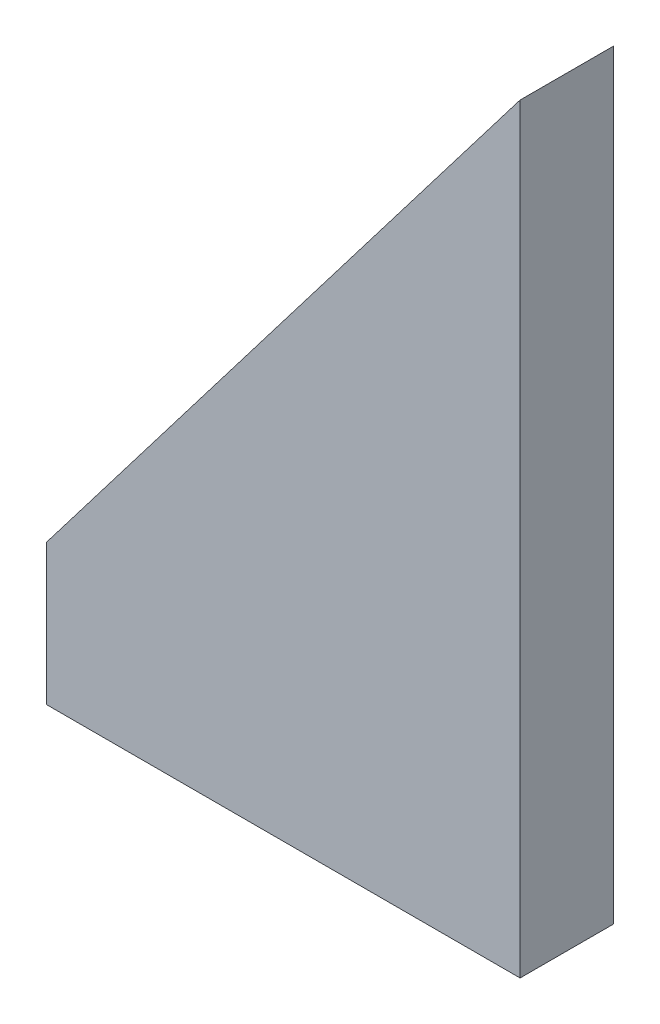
ISO-10303-21;
HEADER;
FILE_DESCRIPTION(('STEP AP214'),'2;1');
FILE_NAME('part.step','',(''),(''),'','','');
FILE_SCHEMA(('AUTOMOTIVE_DESIGN { 1 0 10303 214 1 1 1 1 }'));
ENDSEC;
DATA;
#1=APPLICATION_CONTEXT('core data for automotive mechanical design processes');
#2=APPLICATION_PROTOCOL_DEFINITION('international standard','automotive_design',2000,#1);
#3=PRODUCT_CONTEXT('',#1,'mechanical');
#4=PRODUCT('Part','Part','',(#3));
#5=PRODUCT_RELATED_PRODUCT_CATEGORY('part','',(#4));
#6=PRODUCT_DEFINITION_FORMATION('','',#4);
#7=PRODUCT_DEFINITION_CONTEXT('part definition',#1,'design');
#8=PRODUCT_DEFINITION('design','',#6,#7);
#9=PRODUCT_DEFINITION_SHAPE('','',#8);
#10=(LENGTH_UNIT() NAMED_UNIT(*) SI_UNIT(.MILLI.,.METRE.));
#11=(NAMED_UNIT(*) PLANE_ANGLE_UNIT() SI_UNIT($,.RADIAN.));
#12=(NAMED_UNIT(*) SI_UNIT($,.STERADIAN.) SOLID_ANGLE_UNIT());
#13=UNCERTAINTY_MEASURE_WITH_UNIT(LENGTH_MEASURE(1.E-05),#10,'distance_accuracy_value','');
#14=(GEOMETRIC_REPRESENTATION_CONTEXT(3) GLOBAL_UNCERTAINTY_ASSIGNED_CONTEXT((#13)) GLOBAL_UNIT_ASSIGNED_CONTEXT((#10,
#11,#12)) REPRESENTATION_CONTEXT('',''));
#15=CARTESIAN_POINT('',(0.,0.,0.));
#16=DIRECTION('',(0.,0.,1.));
#17=DIRECTION('',(1.,0.,0.));
#18=AXIS2_PLACEMENT_3D('',#15,#16,#17);
#19=CARTESIAN_POINT('',(40.5,0.,8.));
#20=DIRECTION('',(0.,1.,0.));
#21=DIRECTION('',(-1.,0.,0.));
#22=AXIS2_PLACEMENT_3D('',#19,#20,#21);
#23=PLANE('',#22);
#24=DIRECTION('',(1.,0.,0.));
#25=VECTOR('',#24,1.);
#26=CARTESIAN_POINT('',(40.5,0.,0.));
#27=LINE('',#26,#25);
#28=CARTESIAN_POINT('',(0.,0.,0.));
#29=VERTEX_POINT('',#28);
#30=CARTESIAN_POINT('',(40.5,0.,0.));
#31=VERTEX_POINT('',#30);
#32=EDGE_CURVE('E94',#29,#31,#27,.T.);
#33=ORIENTED_EDGE('',*,*,#32,.T.);
#34=DIRECTION('',(0.,0.,-1.));
#35=VECTOR('',#34,1.);
#36=CARTESIAN_POINT('',(40.5,0.,8.));
#37=LINE('',#36,#35);
#38=CARTESIAN_POINT('',(40.5,0.,8.));
#39=VERTEX_POINT('',#38);
#40=EDGE_CURVE('E11',#39,#31,#37,.T.);
#41=ORIENTED_EDGE('',*,*,#40,.F.);
#42=DIRECTION('',(1.,0.,0.));
#43=VECTOR('',#42,1.);
#44=CARTESIAN_POINT('',(40.5,0.,8.));
#45=LINE('',#44,#43);
#46=CARTESIAN_POINT('',(0.,0.,8.));
#47=VERTEX_POINT('',#46);
#48=EDGE_CURVE('E82',#47,#39,#45,.T.);
#49=ORIENTED_EDGE('',*,*,#48,.F.);
#50=DIRECTION('',(0.,0.,-1.));
#51=VECTOR('',#50,1.);
#52=CARTESIAN_POINT('',(0.,0.,8.));
#53=LINE('',#52,#51);
#54=EDGE_CURVE('E90',#47,#29,#53,.T.);
#55=ORIENTED_EDGE('',*,*,#54,.T.);
#56=EDGE_LOOP('',(#33,#41,#49,#55));
#57=FACE_BOUND('',#56,.T.);
#58=ADVANCED_FACE('F31',(#57),#23,.F.);
#59=CARTESIAN_POINT('',(40.5,65.,8.));
#60=DIRECTION('',(-1.,0.,0.));
#61=DIRECTION('',(0.,-1.,0.));
#62=AXIS2_PLACEMENT_3D('',#59,#60,#61);
#63=PLANE('',#62);
#64=DIRECTION('',(0.,1.,0.));
#65=VECTOR('',#64,1.);
#66=CARTESIAN_POINT('',(40.5,65.,0.));
#67=LINE('',#66,#65);
#68=CARTESIAN_POINT('',(40.5,65.,0.));
#69=VERTEX_POINT('',#68);
#70=EDGE_CURVE('E86',#31,#69,#67,.T.);
#71=ORIENTED_EDGE('',*,*,#70,.T.);
#72=DIRECTION('',(0.,0.,-1.));
#73=VECTOR('',#72,1.);
#74=CARTESIAN_POINT('',(40.5,65.,8.));
#75=LINE('',#74,#73);
#76=CARTESIAN_POINT('',(40.5,65.,8.));
#77=VERTEX_POINT('',#76);
#78=EDGE_CURVE('E39',#77,#69,#75,.T.);
#79=ORIENTED_EDGE('',*,*,#78,.F.);
#80=DIRECTION('',(0.,1.,0.));
#81=VECTOR('',#80,1.);
#82=CARTESIAN_POINT('',(40.5,65.,8.));
#83=LINE('',#82,#81);
#84=EDGE_CURVE('E77',#39,#77,#83,.T.);
#85=ORIENTED_EDGE('',*,*,#84,.F.);
#86=ORIENTED_EDGE('',*,*,#40,.T.);
#87=EDGE_LOOP('',(#71,#79,#85,#86));
#88=FACE_BOUND('',#87,.T.);
#89=ADVANCED_FACE('F85',(#88),#63,.F.);
#90=CARTESIAN_POINT('',(0.,12.,8.));
#91=DIRECTION('',(0.794570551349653,-0.607171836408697,0.));
#92=DIRECTION('',(0.607171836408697,0.794570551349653,0.));
#93=AXIS2_PLACEMENT_3D('',#90,#91,#92);
#94=PLANE('',#93);
#95=DIRECTION('',(-0.607171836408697,-0.794570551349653,0.));
#96=VECTOR('',#95,1.);
#97=CARTESIAN_POINT('',(0.,12.,0.));
#98=LINE('',#97,#96);
#99=CARTESIAN_POINT('',(0.,12.,0.));
#100=VERTEX_POINT('',#99);
#101=EDGE_CURVE('E64',#69,#100,#98,.T.);
#102=ORIENTED_EDGE('',*,*,#101,.T.);
#103=DIRECTION('',(0.,0.,-1.));
#104=VECTOR('',#103,1.);
#105=CARTESIAN_POINT('',(0.,12.,8.));
#106=LINE('',#105,#104);
#107=CARTESIAN_POINT('',(0.,12.,8.));
#108=VERTEX_POINT('',#107);
#109=EDGE_CURVE('E87',#108,#100,#106,.T.);
#110=ORIENTED_EDGE('',*,*,#109,.F.);
#111=DIRECTION('',(-0.607171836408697,-0.794570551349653,0.));
#112=VECTOR('',#111,1.);
#113=CARTESIAN_POINT('',(0.,12.,8.));
#114=LINE('',#113,#112);
#115=EDGE_CURVE('E80',#77,#108,#114,.T.);
#116=ORIENTED_EDGE('',*,*,#115,.F.);
#117=ORIENTED_EDGE('',*,*,#78,.T.);
#118=EDGE_LOOP('',(#102,#110,#116,#117));
#119=FACE_BOUND('',#118,.T.);
#120=ADVANCED_FACE('F88',(#119),#94,.F.);
#121=CARTESIAN_POINT('',(0.,0.,8.));
#122=DIRECTION('',(1.,0.,0.));
#123=DIRECTION('',(0.,0.,-1.));
#124=AXIS2_PLACEMENT_3D('',#121,#122,#123);
#125=PLANE('',#124);
#126=DIRECTION('',(0.,-1.,0.));
#127=VECTOR('',#126,1.);
#128=CARTESIAN_POINT('',(0.,0.,0.));
#129=LINE('',#128,#127);
#130=EDGE_CURVE('E70',#100,#29,#129,.T.);
#131=ORIENTED_EDGE('',*,*,#130,.T.);
#132=ORIENTED_EDGE('',*,*,#54,.F.);
#133=DIRECTION('',(0.,-1.,0.));
#134=VECTOR('',#133,1.);
#135=CARTESIAN_POINT('',(0.,0.,8.));
#136=LINE('',#135,#134);
#137=EDGE_CURVE('E47',#108,#47,#136,.T.);
#138=ORIENTED_EDGE('',*,*,#137,.F.);
#139=ORIENTED_EDGE('',*,*,#109,.T.);
#140=EDGE_LOOP('',(#131,#132,#138,#139));
#141=FACE_BOUND('',#140,.T.);
#142=ADVANCED_FACE('F101',(#141),#125,.F.);
#143=CARTESIAN_POINT('',(0.,0.,8.));
#144=DIRECTION('',(0.,0.,-1.));
#145=DIRECTION('',(-1.,0.,0.));
#146=AXIS2_PLACEMENT_3D('',#143,#144,#145);
#147=PLANE('',#146);
#148=ORIENTED_EDGE('',*,*,#48,.T.);
#149=ORIENTED_EDGE('',*,*,#84,.T.);
#150=ORIENTED_EDGE('',*,*,#115,.T.);
#151=ORIENTED_EDGE('',*,*,#137,.T.);
#152=EDGE_LOOP('',(#148,#149,#150,#151));
#153=FACE_BOUND('',#152,.T.);
#154=ADVANCED_FACE('F78',(#153),#147,.F.);
#155=CARTESIAN_POINT('',(0.,0.,0.));
#156=DIRECTION('',(0.,0.,-1.));
#157=DIRECTION('',(-1.,0.,0.));
#158=AXIS2_PLACEMENT_3D('',#155,#156,#157);
#159=PLANE('',#158);
#160=ORIENTED_EDGE('',*,*,#32,.F.);
#161=ORIENTED_EDGE('',*,*,#130,.F.);
#162=ORIENTED_EDGE('',*,*,#101,.F.);
#163=ORIENTED_EDGE('',*,*,#70,.F.);
#164=EDGE_LOOP('',(#160,#161,#162,#163));
#165=FACE_BOUND('',#164,.T.);
#166=ADVANCED_FACE('F104',(#165),#159,.T.);
#167=CLOSED_SHELL('',(#58,#89,#120,#142,#154,#166));
#168=MANIFOLD_SOLID_BREP('B2',#167);
#169=ADVANCED_BREP_SHAPE_REPRESENTATION('',(#18,#168),#14);
#170=SHAPE_DEFINITION_REPRESENTATION(#9,#169);
ENDSEC;
END-ISO-10303-21;
